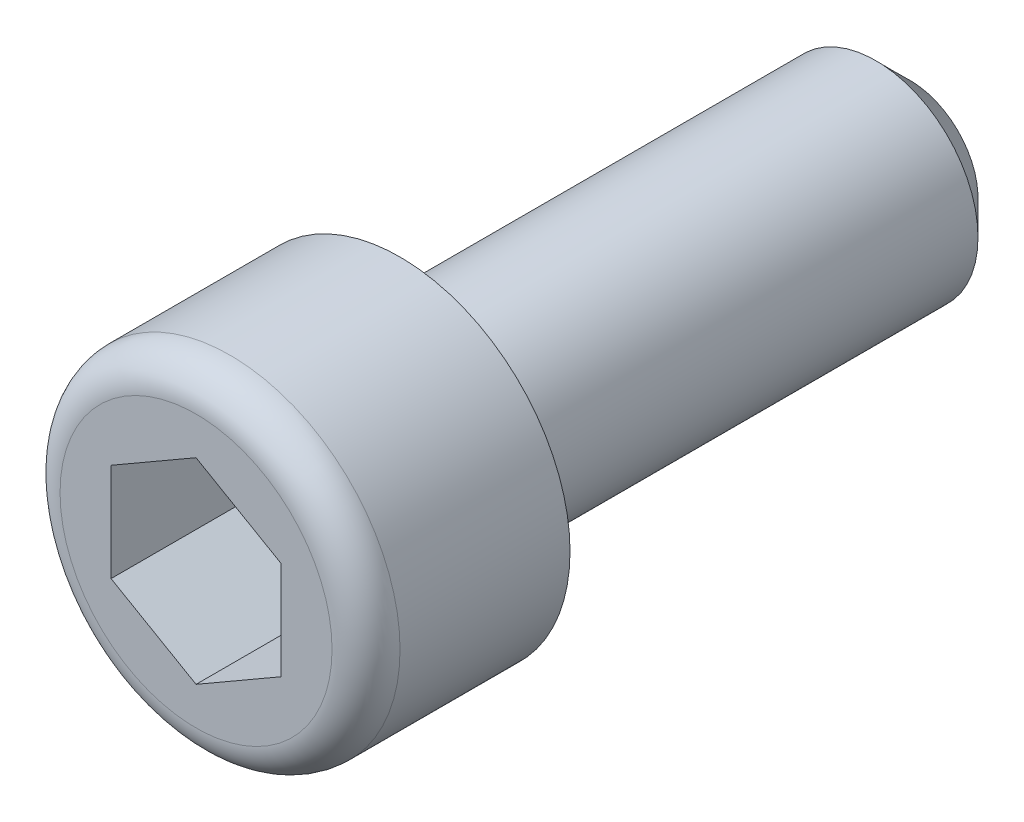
from build123d import *

# Parameters (mm, degrees)
ESQUISSE1_R             = 5
BASE_EXTRUSION_DEPTH    = 6
ESQUISSE2_R             = 3
BOSS_EXTRU_1_DEPTH      = 15
CHANFREIN1_SIZE         = 1
ENL_V_MAT_EXTRU_1_DEPTH = 4
CONG_1_R                = 1


with BuildPart() as part:
    # Esquisse1 → Base-Extrusion (new body)
    with BuildSketch(Plane.XY):
        Circle(ESQUISSE1_R)
    extrude(amount=-BASE_EXTRUSION_DEPTH)

    # Esquisse2 → Boss.-Extru.1 (add)
    with BuildSketch(Plane(origin=(0, 0, -6), x_dir=(-1, 0, 0), z_dir=(0, 0, -1))):
        with Locations(Location((0, 0, 0), (0, 0, 180))):
            Circle(ESQUISSE2_R)
    extrude(amount=BOSS_EXTRU_1_DEPTH)

    # Chanfrein1
    chanfrein1_edges = [part.edges().sort_by_distance(p)[0] for p in [
        (-3, 0, -21),
    ]]
    chamfer(chanfrein1_edges, length=CHANFREIN1_SIZE)

    # Esquisse3 → Enl_v. mat.-Extru.1 (cut)
    with BuildSketch(Plane.XY):
        Polygon((-2.5, -1.443375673), (0, -2.886751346), (2.5, -1.443375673), (2.5, 1.443375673), (0, 2.886751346), (-2.5, 1.443375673), align=None)
    extrude(amount=-ENL_V_MAT_EXTRU_1_DEPTH, mode=Mode.SUBTRACT)

    # Cong_1
    cong_1_edges = [part.edges().sort_by_distance(p)[0] for p in [
        (-5, 0, 0),
    ]]
    fillet(cong_1_edges, radius=CONG_1_R)


solid = part.part
